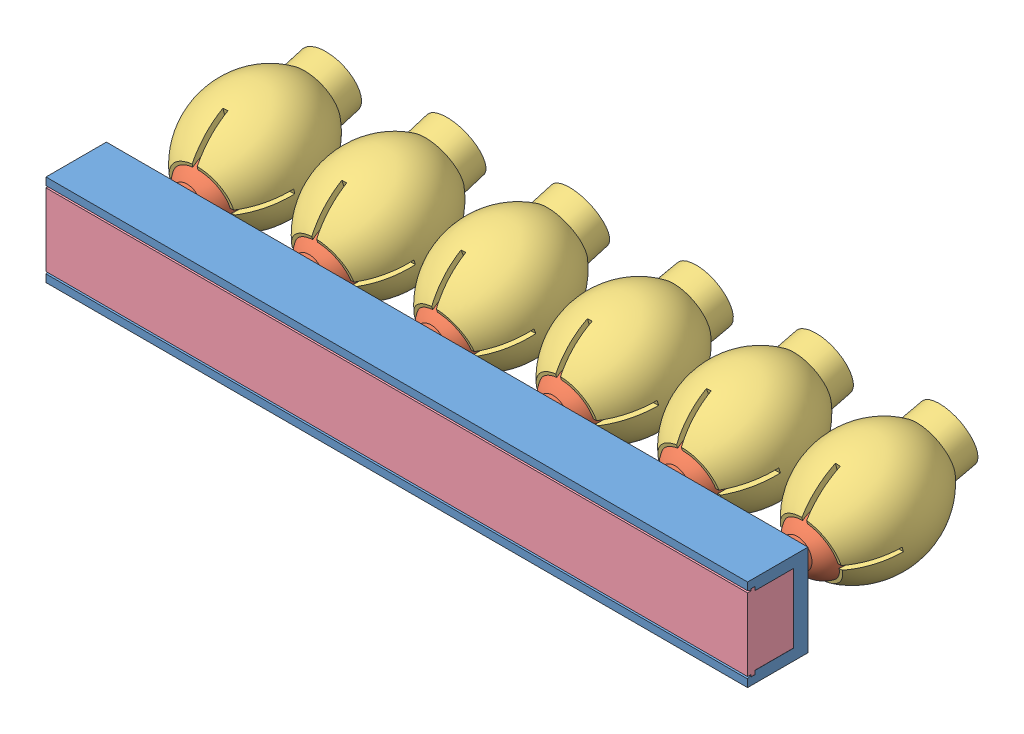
SolidWorks assembly LED light strip assembly.SLDASM, configuration Default (file format 8000). Lengths in mm.
Overall size (153.56 33.73 54.42).
15 component instances, 5 part files, 18 mates.
Components (placement in the parent):
- straight light strip-1: straight light strip.SLDPRT [Default] at (-121.6653 -29.0647 32.6553) size (146.05 19.05 12.57)
- pivot2-1: pivot2.SLDPRT [Default] at (-112.1403 -19.5397 35.6994) x (0 0 1) z (-1 0 0) size (21.55 12.7 12.7)
- pivot2-2: pivot2.SLDPRT [Default] at (-86.7403 -19.5397 35.6994) x (0 0 1) z (-1 0 0) size (21.55 12.7 12.7)
- pivot2-3: pivot2.SLDPRT [Default] at (-61.3403 -19.5397 35.6994) x (0 0 1) z (-1 0 0) size (21.55 12.7 12.7)
- pivot2-4: pivot2.SLDPRT [Default] at (-35.9403 -19.5397 35.6994) x (0 0 1) z (-1 0 0) size (21.55 12.7 12.7)
- pivot2-5: pivot2.SLDPRT [Default] at (-10.5403 -19.5397 35.6994) x (0 0 1) z (-1 0 0) size (21.55 12.7 12.7)
- pivot2-6: pivot2.SLDPRT [Default] at (14.8597 -19.5397 35.6994) x (0 0 1) z (-0.079862 0.996806 0) size (21.55 12.7 12.7)
- led holder-1: led holder.SLDPRT [Default] at (-111.882 -20.9549 25.8789) x (0.999014 0.024802 -0.036826) z (-0.015755 0.973483 0.228216) size (24.16 28.67 24.16)
- led holder-2: led holder.SLDPRT [Default] at (-86.7326 -21.3561 25.7765) x (0.99974 0.022127 0.005464) z (-0.022759 0.956202 0.291821) size (24.16 28.67 24.16)
- led holder-3: led holder.SLDPRT [Default] at (-61.4769 -21.4481 25.746) x (0.997074 0.062993 0.043298) z (-0.07322 0.949731 0.304385) size (24.16 28.67 24.16)
- led holder-4: led holder.SLDPRT [Default] at (-36.0439 -20.9798 25.8776) x (0.997088 0.068572 0.033382) z (-0.074426 0.970439 0.229585) size (24.16 28.67 24.16)
- led holder-5: led holder.SLDPRT [Default] at (-10.5431 -21.0755 25.8549) x (0.994542 0.101003 0.026181) z (-0.10434 0.963792 0.245395) size (24.16 28.67 24.16)
- led holder-6: led holder.SLDPRT [Default] at (14.6668 -21.1594 25.8299) x (0.999119 -0.035396 0.022553) z (0.028289 0.964889 0.261129) size (24.16 28.67 24.16)
- back plate of straight strip-1: back plate of straight strip.SLDPRT [Default] at (-121.6653 -27.4645 43.7043) x (0 1 0) z (1 0 0) size (15.88 9.53 146.05)
- push button-1: push button.SLDPRT [Default] at (-101.6346 -19.5397 37.6845) x (-1 0 0) z (0 0 -1) size (27.23 8.1 8.08)
Mates (geometry in assembly coordinates):
- Coincident2: coincident aligned: cone of straight light strip-1 through (-112.1403 -19.5397 35.7033) axis (0 0 1); cone of pivot2-1 through (-112.1403 -19.5397 35.7035) axis (0 0 1)
- Coincident3: coincident aligned: cone of straight light strip-1 through (-86.7403 -19.5397 35.7033) axis (0 0 1); cone of pivot2-2 through (-86.7403 -19.5397 35.7035) axis (0 0 1)
- Coincident4: coincident aligned: cone of straight light strip-1 through (-61.3403 -19.5397 35.7033) axis (0 0 1); cone of pivot2-3 through (-61.3403 -19.5397 35.7035) axis (0 0 1)
- Coincident5: coincident aligned: cone of straight light strip-1 through (-35.9403 -19.5397 35.7033) axis (0 0 1); cone of pivot2-4 through (-35.9403 -19.5397 35.7035) axis (0 0 1)
- Coincident6: coincident aligned: cone of straight light strip-1 through (-10.5403 -19.5397 35.7033) axis (0 0 1); cone of pivot2-5 through (-10.5403 -19.5397 35.7035) axis (0 0 1)
- Coincident7: coincident aligned: cone of straight light strip-1 through (14.8597 -19.5397 35.7033) axis (0 0 1); cone of pivot2-6 through (14.8597 -19.5397 35.7035) axis (0 0 1)
- Concentric1: concentric: sphere of pivot2-6; sphere of led holder-6
- Concentric2: concentric: sphere of pivot2-5; sphere of led holder-5
- Concentric3: concentric: sphere of pivot2-4; sphere of led holder-4
- Concentric4: concentric: sphere of pivot2-3; sphere of led holder-3
- Concentric5: concentric: sphere of pivot2-2; sphere of led holder-2
- Concentric6: concentric: sphere of pivot2-1; sphere of led holder-1
- Coincident8: coincident anti-aligned: plane of straight light strip-1 through (-121.6653 -29.0647 35.7033) normal (0 0 1); plane of back plate of straight strip-1 through (-121.6653 -27.4645 35.7033) normal (0 0 -1)
- Coincident9: coincident anti-aligned: plane of straight light strip-1 through (24.3847 -12.3515 43.7043) normal (0 -1 0); plane of back plate of straight strip-1 through (-121.6653 -12.3515 35.7033) normal (0 1 0)
- Coincident10: coincident aligned: plane of straight light strip-1 through (24.3847 -29.0647 35.7033) normal (1 0 0); plane of back plate of straight strip-1 through (24.3847 -27.4645 43.7043) normal (1 0 0)
- Coincident11: coincident: plane of straight light strip-1 through (-101.6346 -19.5397 33.6713) normal (0 0 1); plane of push button-1 through (-101.6346 -19.5397 33.6713) normal (0 0 -1)
- Concentric7: concentric: cylinder of straight light strip-1 through (-101.6346 -19.5397 33.6713) axis (0 0 1) radius 6.096; cylinder of push button-1 through (-101.6346 -19.5397 33.6713) axis (0 0 1) radius 6.0325
- Parallel1: parallel anti-aligned: plane of straight light strip-1 through (-106.1783 -15.4757 33.6713) normal (0 -1 0); plane of push button-1 through (-97.1649 -15.4884 33.6713) normal (0 1 0)
